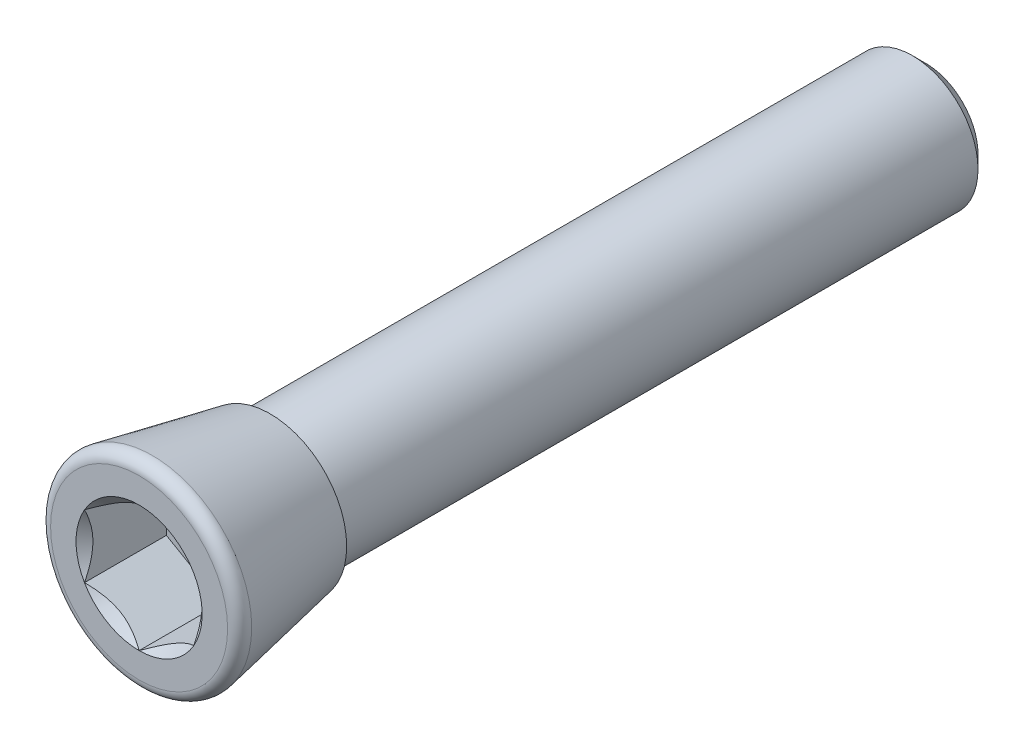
ISO-10303-21;
HEADER;
FILE_DESCRIPTION(('STEP AP214'),'2;1');
FILE_NAME('part.step','',(''),(''),'','','');
FILE_SCHEMA(('AUTOMOTIVE_DESIGN { 1 0 10303 214 1 1 1 1 }'));
ENDSEC;
DATA;
#1=APPLICATION_CONTEXT('core data for automotive mechanical design processes');
#2=APPLICATION_PROTOCOL_DEFINITION('international standard','automotive_design',2000,#1);
#3=PRODUCT_CONTEXT('',#1,'mechanical');
#4=PRODUCT('Part','Part','',(#3));
#5=PRODUCT_RELATED_PRODUCT_CATEGORY('part','',(#4));
#6=PRODUCT_DEFINITION_FORMATION('','',#4);
#7=PRODUCT_DEFINITION_CONTEXT('part definition',#1,'design');
#8=PRODUCT_DEFINITION('design','',#6,#7);
#9=PRODUCT_DEFINITION_SHAPE('','',#8);
#10=(LENGTH_UNIT() NAMED_UNIT(*) SI_UNIT(.MILLI.,.METRE.));
#11=(NAMED_UNIT(*) PLANE_ANGLE_UNIT() SI_UNIT($,.RADIAN.));
#12=(NAMED_UNIT(*) SI_UNIT($,.STERADIAN.) SOLID_ANGLE_UNIT());
#13=UNCERTAINTY_MEASURE_WITH_UNIT(LENGTH_MEASURE(1.E-05),#10,'distance_accuracy_value','');
#14=(GEOMETRIC_REPRESENTATION_CONTEXT(3) GLOBAL_UNCERTAINTY_ASSIGNED_CONTEXT((#13)) GLOBAL_UNIT_ASSIGNED_CONTEXT((#10,
#11,#12)) REPRESENTATION_CONTEXT('',''));
#15=CARTESIAN_POINT('',(0.,0.,0.));
#16=DIRECTION('',(0.,0.,1.));
#17=DIRECTION('',(1.,0.,0.));
#18=AXIS2_PLACEMENT_3D('',#15,#16,#17);
#19=CARTESIAN_POINT('',(0.,0.,0.));
#20=DIRECTION('',(0.,0.,1.));
#21=DIRECTION('',(1.,0.,0.));
#22=AXIS2_PLACEMENT_3D('',#19,#20,#21);
#23=PLANE('',#22);
#24=CARTESIAN_POINT('',(0.,0.,2.9549279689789E-11));
#25=DIRECTION('',(0.,0.,1.));
#26=DIRECTION('',(1.,0.,0.));
#27=AXIS2_PLACEMENT_3D('',#24,#25,#26);
#28=CIRCLE('',#27,3.50127142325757);
#29=CARTESIAN_POINT('',(3.50127142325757,0.,2.9549279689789E-11));
#30=VERTEX_POINT('',#29);
#31=EDGE_CURVE('E233',#30,#30,#28,.T.);
#32=ORIENTED_EDGE('',*,*,#31,.F.);
#33=EDGE_LOOP('',(#32));
#34=FACE_BOUND('',#33,.T.);
#35=CARTESIAN_POINT('',(0.,0.,0.));
#36=DIRECTION('',(0.,0.,1.));
#37=DIRECTION('',(1.,0.,0.));
#38=AXIS2_PLACEMENT_3D('',#35,#36,#37);
#39=CIRCLE('',#38,3.);
#40=CARTESIAN_POINT('',(3.,0.,0.));
#41=VERTEX_POINT('',#40);
#42=EDGE_CURVE('E310',#41,#41,#39,.F.);
#43=ORIENTED_EDGE('',*,*,#42,.F.);
#44=EDGE_LOOP('',(#43));
#45=FACE_BOUND('',#44,.T.);
#46=ADVANCED_FACE('F14',(#34,#45),#23,.F.);
#47=CARTESIAN_POINT('',(2.5,-1.44337567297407,2.25));
#48=DIRECTION('',(1.,0.,0.));
#49=DIRECTION('',(0.,-1.,0.));
#50=AXIS2_PLACEMENT_3D('',#47,#48,#49);
#51=PLANE('',#50);
#52=CARTESIAN_POINT('',(2.49999999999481,1.44337567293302,6.00000000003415));
#53=CARTESIAN_POINT('',(2.49999999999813,1.3448047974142,5.95076054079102));
#54=CARTESIAN_POINT('',(2.4999999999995,1.24459631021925,5.90439618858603));
#55=CARTESIAN_POINT('',(2.5000000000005,1.04022304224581,5.81940939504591));
#56=CARTESIAN_POINT('',(2.50000000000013,0.936037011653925,5.78083850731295));
#57=CARTESIAN_POINT('',(2.49999999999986,0.72465381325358,5.71423485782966));
#58=CARTESIAN_POINT('',(2.49999999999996,0.61746818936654,5.68616643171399));
#59=CARTESIAN_POINT('',(2.50000000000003,0.400747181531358,5.64295393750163));
#60=CARTESIAN_POINT('',(2.50000000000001,0.291220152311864,5.62776990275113));
#61=CARTESIAN_POINT('',(2.5,0.151078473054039,5.6176265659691));
#62=CARTESIAN_POINT('',(2.5,0.120877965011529,5.6159866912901));
#63=CARTESIAN_POINT('',(2.5,0.0604529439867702,5.61379762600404));
#64=CARTESIAN_POINT('',(2.5,0.0302284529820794,5.61324784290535));
#65=CARTESIAN_POINT('',(2.5,-0.0758674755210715,5.61325068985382));
#66=CARTESIAN_POINT('',(2.5,-0.151759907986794,5.61672098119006));
#67=CARTESIAN_POINT('',(2.5,-0.302963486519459,5.63041108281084));
#68=CARTESIAN_POINT('',(2.5,-0.378274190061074,5.6406356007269));
#69=CARTESIAN_POINT('',(2.5,-0.528122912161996,5.66735317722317));
#70=CARTESIAN_POINT('',(2.5,-0.602655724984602,5.6838750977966));
#71=CARTESIAN_POINT('',(2.5,-0.750290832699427,5.72243537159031));
#72=CARTESIAN_POINT('',(2.5,-0.823392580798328,5.74447579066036));
#73=CARTESIAN_POINT('',(2.5,-0.990079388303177,5.80069051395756));
#74=CARTESIAN_POINT('',(2.5,-1.08310139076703,5.83651478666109));
#75=CARTESIAN_POINT('',(2.5,-1.2656234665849,5.9141573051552));
#76=CARTESIAN_POINT('',(2.5,-1.35514797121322,5.95591772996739));
#77=CARTESIAN_POINT('',(2.5,-1.44337567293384,6.0000000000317));
#78=B_SPLINE_CURVE_WITH_KNOTS('',3,(#52,#53,#54,#55,#56,#57,#58,#59,#60,#61,#62,#63,#64,#65,#66,
#67,#68,#69,#70,#71,#72,#73,#74,#75,#76,#77),.UNSPECIFIED.,.F.,.F.,(4,2,2,2,2,2,2,2,2,2,2,2,4),
(0.,0.330782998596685,0.663687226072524,0.995450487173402,1.32618083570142,1.4169022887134,
1.50757441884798,1.73514364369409,1.96287164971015,2.19165616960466,2.42052646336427,
2.71929868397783,3.01533817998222),.UNSPECIFIED.);
#79=CARTESIAN_POINT('',(2.49999999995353,1.44337567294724,5.99999999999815));
#80=VERTEX_POINT('',#79);
#81=CARTESIAN_POINT('',(2.49999999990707,-1.44337567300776,5.9999999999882));
#82=VERTEX_POINT('',#81);
#83=EDGE_CURVE('E69',#80,#82,#78,.T.);
#84=ORIENTED_EDGE('',*,*,#83,.F.);
#85=DIRECTION('',(0.,0.,-1.));
#86=VECTOR('',#85,1.);
#87=CARTESIAN_POINT('',(2.5,1.44337567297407,2.25));
#88=LINE('',#87,#86);
#89=CARTESIAN_POINT('',(2.5,1.44337567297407,2.25));
#90=VERTEX_POINT('',#89);
#91=EDGE_CURVE('E75',#80,#90,#88,.T.);
#92=ORIENTED_EDGE('',*,*,#91,.T.);
#93=DIRECTION('',(0.,1.,0.));
#94=VECTOR('',#93,1.);
#95=CARTESIAN_POINT('',(2.5,0.,2.25));
#96=LINE('',#95,#94);
#97=CARTESIAN_POINT('',(2.5,-1.44337567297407,2.25));
#98=VERTEX_POINT('',#97);
#99=EDGE_CURVE('E79',#90,#98,#96,.F.);
#100=ORIENTED_EDGE('',*,*,#99,.T.);
#101=DIRECTION('',(0.,0.,-1.));
#102=VECTOR('',#101,1.);
#103=CARTESIAN_POINT('',(2.5,-1.44337567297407,2.25));
#104=LINE('',#103,#102);
#105=EDGE_CURVE('E77',#98,#82,#104,.F.);
#106=ORIENTED_EDGE('',*,*,#105,.T.);
#107=EDGE_LOOP('',(#84,#92,#100,#106));
#108=FACE_BOUND('',#107,.T.);
#109=ADVANCED_FACE('F73',(#108),#51,.F.);
#110=CARTESIAN_POINT('',(5.,0.,2.25));
#111=DIRECTION('',(0.,0.,-1.));
#112=DIRECTION('',(-1.,0.,0.));
#113=AXIS2_PLACEMENT_3D('',#110,#111,#112);
#114=PLANE('',#113);
#115=DIRECTION('',(0.866025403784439,0.5,0.));
#116=VECTOR('',#115,1.);
#117=CARTESIAN_POINT('',(0.,2.88675134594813,2.25));
#118=LINE('',#117,#116);
#119=CARTESIAN_POINT('',(0.,2.88675134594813,2.25));
#120=VERTEX_POINT('',#119);
#121=CARTESIAN_POINT('',(-2.5,1.44337567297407,2.25));
#122=VERTEX_POINT('',#121);
#123=EDGE_CURVE('E267',#120,#122,#118,.F.);
#124=ORIENTED_EDGE('',*,*,#123,.T.);
#125=DIRECTION('',(0.,1.,0.));
#126=VECTOR('',#125,1.);
#127=CARTESIAN_POINT('',(-2.5,1.44337567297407,2.25));
#128=LINE('',#127,#126);
#129=CARTESIAN_POINT('',(-2.5,-1.44337567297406,2.25));
#130=VERTEX_POINT('',#129);
#131=EDGE_CURVE('E273',#122,#130,#128,.F.);
#132=ORIENTED_EDGE('',*,*,#131,.T.);
#133=DIRECTION('',(-0.866025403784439,0.5,0.));
#134=VECTOR('',#133,1.);
#135=CARTESIAN_POINT('',(-2.5,-1.44337567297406,2.25));
#136=LINE('',#135,#134);
#137=CARTESIAN_POINT('',(0.,-2.88675134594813,2.25));
#138=VERTEX_POINT('',#137);
#139=EDGE_CURVE('E279',#130,#138,#136,.F.);
#140=ORIENTED_EDGE('',*,*,#139,.T.);
#141=DIRECTION('',(-0.866025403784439,-0.5,0.));
#142=VECTOR('',#141,1.);
#143=CARTESIAN_POINT('',(0.,-2.88675134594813,2.25));
#144=LINE('',#143,#142);
#145=EDGE_CURVE('E100',#138,#98,#144,.F.);
#146=ORIENTED_EDGE('',*,*,#145,.T.);
#147=ORIENTED_EDGE('',*,*,#99,.F.);
#148=DIRECTION('',(0.866025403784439,-0.5,0.));
#149=VECTOR('',#148,1.);
#150=CARTESIAN_POINT('',(2.5,1.44337567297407,2.25));
#151=LINE('',#150,#149);
#152=EDGE_CURVE('E99',#90,#120,#151,.F.);
#153=ORIENTED_EDGE('',*,*,#152,.T.);
#154=EDGE_LOOP('',(#124,#132,#140,#146,#147,#153));
#155=FACE_BOUND('',#154,.T.);
#156=ADVANCED_FACE('F182',(#155),#114,.F.);
#157=CARTESIAN_POINT('',(2.5,1.44337567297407,2.25));
#158=DIRECTION('',(0.5,0.866025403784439,0.));
#159=DIRECTION('',(0.866025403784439,-0.5,0.));
#160=AXIS2_PLACEMENT_3D('',#157,#158,#159);
#161=PLANE('',#160);
#162=CARTESIAN_POINT('',(2.49999999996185,1.4433756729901,6.00000000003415));
#163=CARTESIAN_POINT('',(2.41407377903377,1.49298519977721,5.95043808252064));
#164=CARTESIAN_POINT('',(2.32671086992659,1.54342419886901,5.90378750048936));
#165=CARTESIAN_POINT('',(2.14856893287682,1.64627449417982,5.81837227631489));
#166=CARTESIAN_POINT('',(2.05777297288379,1.69869556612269,5.77965514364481));
#167=CARTESIAN_POINT('',(1.87468737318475,1.80440008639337,5.71333243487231));
#168=CARTESIAN_POINT('',(1.78244433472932,1.85765662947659,5.68556020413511));
#169=CARTESIAN_POINT('',(1.59592809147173,1.96534183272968,5.64277179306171));
#170=CARTESIAN_POINT('',(1.50166058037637,2.01976720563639,5.62772368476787));
#171=CARTESIAN_POINT('',(1.33918618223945,2.11357184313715,5.61414605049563));
#172=CARTESIAN_POINT('',(1.27118905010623,2.15283000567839,5.61213672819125));
#173=CARTESIAN_POINT('',(1.1353060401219,2.23128209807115,5.61552620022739));
#174=CARTESIAN_POINT('',(1.06742020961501,2.27047600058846,5.6209275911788));
#175=CARTESIAN_POINT('',(0.932289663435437,2.34849365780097,5.63883111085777));
#176=CARTESIAN_POINT('',(0.865045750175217,2.38731694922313,5.65134117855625));
#177=CARTESIAN_POINT('',(0.731720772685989,2.46429216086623,5.68277536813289));
#178=CARTESIAN_POINT('',(0.665639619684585,2.50244413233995,5.70169899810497));
#179=CARTESIAN_POINT('',(0.496416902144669,2.60014491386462,5.75786430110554));
#180=CARTESIAN_POINT('',(0.394323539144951,2.65908854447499,5.79933497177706));
#181=CARTESIAN_POINT('',(0.244203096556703,2.74576062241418,5.86934112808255));
#182=CARTESIAN_POINT('',(0.194731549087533,2.77432303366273,5.8939377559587));
#183=CARTESIAN_POINT('',(0.0967044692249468,2.83091899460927,5.9453728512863));
#184=CARTESIAN_POINT('',(0.0481483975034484,2.85895285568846,5.97220994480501));
#185=CARTESIAN_POINT('',(3.91885946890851E-11,2.8867513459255,6.0000000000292));
#186=B_SPLINE_CURVE_WITH_KNOTS('',3,(#162,#163,#164,#165,#166,#167,#168,#169,#170,#171,#172,
#173,#174,#175,#176,#177,#178,#179,#180,#181,#182,#183,#184,#185),.UNSPECIFIED.,.F.,.F.,(4,2,2,
2,2,2,2,2,2,2,2,4),(0.,0.332957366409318,0.66785385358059,0.997433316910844,1.32618330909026,
1.56147590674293,1.79685096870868,2.03248941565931,2.26810979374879,2.6422318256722,
2.82878537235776,3.0152253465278),.UNSPECIFIED.);
#187=CARTESIAN_POINT('',(0.,2.88675134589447,5.99999999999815));
#188=VERTEX_POINT('',#187);
#189=EDGE_CURVE('E96',#80,#188,#186,.T.);
#190=ORIENTED_EDGE('',*,*,#189,.T.);
#191=DIRECTION('',(0.,0.,-1.));
#192=VECTOR('',#191,1.);
#193=CARTESIAN_POINT('',(0.,2.88675134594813,2.25));
#194=LINE('',#193,#192);
#195=EDGE_CURVE('E106',#188,#120,#194,.T.);
#196=ORIENTED_EDGE('',*,*,#195,.T.);
#197=ORIENTED_EDGE('',*,*,#152,.F.);
#198=ORIENTED_EDGE('',*,*,#91,.F.);
#199=EDGE_LOOP('',(#190,#196,#197,#198));
#200=FACE_BOUND('',#199,.T.);
#201=ADVANCED_FACE('F94',(#200),#161,.F.);
#202=CARTESIAN_POINT('',(0.,-2.88675134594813,2.25));
#203=DIRECTION('',(0.5,-0.866025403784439,0.));
#204=DIRECTION('',(-0.866025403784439,-0.5,0.));
#205=AXIS2_PLACEMENT_3D('',#202,#203,#204);
#206=PLANE('',#205);
#207=CARTESIAN_POINT('',(3.62454307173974E-11,-2.88675134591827,6.0000000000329));
#208=CARTESIAN_POINT('',(0.0859262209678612,-2.83714181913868,5.95043808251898));
#209=CARTESIAN_POINT('',(0.173289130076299,-2.78670282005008,5.9037875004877));
#210=CARTESIAN_POINT('',(0.351431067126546,-2.68385252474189,5.81837227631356));
#211=CARTESIAN_POINT('',(0.442227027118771,-2.63143145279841,5.77965514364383));
#212=CARTESIAN_POINT('',(0.625312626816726,-2.52572693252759,5.71333243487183));
#213=CARTESIAN_POINT('',(0.717555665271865,-2.47247038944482,5.68556020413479));
#214=CARTESIAN_POINT('',(0.904071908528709,-2.36478518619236,5.64277179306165));
#215=CARTESIAN_POINT('',(0.998339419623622,-2.31035981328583,5.62772368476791));
#216=CARTESIAN_POINT('',(1.16081381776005,-2.21655517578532,5.61414605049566));
#217=CARTESIAN_POINT('',(1.22881094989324,-2.17729701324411,5.61213672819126));
#218=CARTESIAN_POINT('',(1.36469395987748,-2.09884492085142,5.61552620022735));
#219=CARTESIAN_POINT('',(1.43257979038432,-2.05965101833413,5.62092759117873));
#220=CARTESIAN_POINT('',(1.56771033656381,-1.98163336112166,5.63883111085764));
#221=CARTESIAN_POINT('',(1.63495424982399,-1.94281006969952,5.65134117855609));
#222=CARTESIAN_POINT('',(1.76827922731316,-1.86583485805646,5.68277536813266));
#223=CARTESIAN_POINT('',(1.83436038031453,-1.82768288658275,5.70169899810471));
#224=CARTESIAN_POINT('',(2.00358309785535,-1.72998210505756,5.7578643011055));
#225=CARTESIAN_POINT('',(2.10567646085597,-1.67103847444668,5.79933497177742));
#226=CARTESIAN_POINT('',(2.25579690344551,-1.58436639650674,5.86934112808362));
#227=CARTESIAN_POINT('',(2.3052684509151,-1.55580398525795,5.89393775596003));
#228=CARTESIAN_POINT('',(2.40329553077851,-1.49920802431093,5.94537285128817));
#229=CARTESIAN_POINT('',(2.45185160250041,-1.4711741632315,5.97220994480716));
#230=CARTESIAN_POINT('',(2.49999999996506,-1.44337567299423,6.00000000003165));
#231=B_SPLINE_CURVE_WITH_KNOTS('',3,(#207,#208,#209,#210,#211,#212,#213,#214,#215,#216,#217,
#218,#219,#220,#221,#222,#223,#224,#225,#226,#227,#228,#229,#230),.UNSPECIFIED.,.F.,.F.,(4,2,2,
2,2,2,2,2,2,2,2,4),(0.,0.332957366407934,0.667853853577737,0.997433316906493,1.32618330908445,
1.56147590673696,1.79685096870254,2.03248941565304,2.26810979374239,2.64223182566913,
2.82878537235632,3.01522534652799),.UNSPECIFIED.);
#232=CARTESIAN_POINT('',(-7.36095430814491E-11,-2.88675134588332,5.999999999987));
#233=VERTEX_POINT('',#232);
#234=EDGE_CURVE('E105',#233,#82,#231,.T.);
#235=ORIENTED_EDGE('',*,*,#234,.T.);
#236=ORIENTED_EDGE('',*,*,#105,.F.);
#237=ORIENTED_EDGE('',*,*,#145,.F.);
#238=DIRECTION('',(0.,0.,-1.));
#239=VECTOR('',#238,1.);
#240=CARTESIAN_POINT('',(0.,-2.88675134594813,2.25));
#241=LINE('',#240,#239);
#242=EDGE_CURVE('E276',#138,#233,#241,.F.);
#243=ORIENTED_EDGE('',*,*,#242,.T.);
#244=EDGE_LOOP('',(#235,#236,#237,#243));
#245=FACE_BOUND('',#244,.T.);
#246=ADVANCED_FACE('F172',(#245),#206,.F.);
#247=CARTESIAN_POINT('',(-2.5,-1.44337567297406,2.25));
#248=DIRECTION('',(-0.5,-0.866025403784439,0.));
#249=DIRECTION('',(-0.866025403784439,0.5,0.));
#250=AXIS2_PLACEMENT_3D('',#247,#248,#249);
#251=PLANE('',#250);
#252=CARTESIAN_POINT('',(-2.49999999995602,-1.44337567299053,6.0000000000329));
#253=CARTESIAN_POINT('',(-2.41407377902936,-1.4929851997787,5.95043808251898));
#254=CARTESIAN_POINT('',(-2.32671086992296,-1.54342419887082,5.9037875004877));
#255=CARTESIAN_POINT('',(-2.14856893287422,-1.6462744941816,5.81837227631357));
#256=CARTESIAN_POINT('',(-2.05777297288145,-1.69869556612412,5.77965514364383));
#257=CARTESIAN_POINT('',(-1.8746873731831,-1.80440008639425,5.71333243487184));
#258=CARTESIAN_POINT('',(-1.7824443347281,-1.85765662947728,5.68556020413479));
#259=CARTESIAN_POINT('',(-1.59592809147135,-1.96534183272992,5.64277179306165));
#260=CARTESIAN_POINT('',(-1.5016605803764,-2.01976720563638,5.62772368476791));
#261=CARTESIAN_POINT('',(-1.33918618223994,-2.11357184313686,5.61414605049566));
#262=CARTESIAN_POINT('',(-1.27118905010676,-2.15283000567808,5.61213672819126));
#263=CARTESIAN_POINT('',(-1.13530604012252,-2.23128209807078,5.61552620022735));
#264=CARTESIAN_POINT('',(-1.06742020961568,-2.27047600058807,5.62092759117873));
#265=CARTESIAN_POINT('',(-0.932289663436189,-2.34849365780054,5.63883111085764));
#266=CARTESIAN_POINT('',(-0.865045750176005,-2.38731694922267,5.65134117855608));
#267=CARTESIAN_POINT('',(-0.731720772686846,-2.46429216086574,5.68277536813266));
#268=CARTESIAN_POINT('',(-0.665639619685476,-2.50244413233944,5.70169899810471));
#269=CARTESIAN_POINT('',(-0.496416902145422,-2.60014491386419,5.75786430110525));
#270=CARTESIAN_POINT('',(-0.394323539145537,-2.65908854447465,5.79933497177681));
#271=CARTESIAN_POINT('',(-0.244203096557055,-2.74576062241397,5.86934112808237));
#272=CARTESIAN_POINT('',(-0.194731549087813,-2.77432303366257,5.89393775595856));
#273=CARTESIAN_POINT('',(-0.0967044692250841,-2.83091899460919,5.94537285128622));
#274=CARTESIAN_POINT('',(-0.0481483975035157,-2.85895285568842,5.97220994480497));
#275=CARTESIAN_POINT('',(-3.91871245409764E-11,-2.8867513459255,6.0000000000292));
#276=B_SPLINE_CURVE_WITH_KNOTS('',3,(#252,#253,#254,#255,#256,#257,#258,#259,#260,#261,#262,
#263,#264,#265,#266,#267,#268,#269,#270,#271,#272,#273,#274,#275),.UNSPECIFIED.,.F.,.F.,(4,2,2,
2,2,2,2,2,2,2,2,4),(0.,0.332957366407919,0.667853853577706,0.997433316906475,1.32618330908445,
1.56147590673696,1.79685096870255,2.03248941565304,2.26810979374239,2.64223182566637,
2.8287853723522,3.0152253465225),.UNSPECIFIED.);
#277=CARTESIAN_POINT('',(-2.49999999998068,-1.44337567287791,5.999999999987));
#278=VERTEX_POINT('',#277);
#279=EDGE_CURVE('E155',#278,#233,#276,.T.);
#280=ORIENTED_EDGE('',*,*,#279,.T.);
#281=ORIENTED_EDGE('',*,*,#242,.F.);
#282=ORIENTED_EDGE('',*,*,#139,.F.);
#283=DIRECTION('',(0.,0.,1.));
#284=VECTOR('',#283,1.);
#285=CARTESIAN_POINT('',(-2.5,-1.44337567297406,2.25));
#286=LINE('',#285,#284);
#287=EDGE_CURVE('E270',#130,#278,#286,.T.);
#288=ORIENTED_EDGE('',*,*,#287,.T.);
#289=EDGE_LOOP('',(#280,#281,#282,#288));
#290=FACE_BOUND('',#289,.T.);
#291=ADVANCED_FACE('F168',(#290),#251,.F.);
#292=CARTESIAN_POINT('',(-2.5,1.44337567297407,2.25));
#293=DIRECTION('',(-1.,0.,0.));
#294=DIRECTION('',(0.,0.,1.));
#295=AXIS2_PLACEMENT_3D('',#292,#293,#294);
#296=PLANE('',#295);
#297=CARTESIAN_POINT('',(-2.49999999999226,1.44337567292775,6.0000000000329));
#298=CARTESIAN_POINT('',(-2.49999999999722,1.34415661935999,5.95043808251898));
#299=CARTESIAN_POINT('',(-2.49999999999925,1.2432786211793,5.9037875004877));
#300=CARTESIAN_POINT('',(-2.50000000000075,1.03757803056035,5.81837227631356));
#301=CARTESIAN_POINT('',(-2.5000000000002,0.932735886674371,5.77965514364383));
#302=CARTESIAN_POINT('',(-2.4999999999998,0.72132684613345,5.71333243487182));
#303=CARTESIAN_POINT('',(-2.49999999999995,0.614813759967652,5.68556020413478));
#304=CARTESIAN_POINT('',(-2.50000000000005,0.399443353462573,5.64277179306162));
#305=CARTESIAN_POINT('',(-2.50000000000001,0.290592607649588,5.62772368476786));
#306=CARTESIAN_POINT('',(-2.49999999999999,0.102983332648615,5.61414605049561));
#307=CARTESIAN_POINT('',(-2.5,0.0244670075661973,5.61213672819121));
#308=CARTESIAN_POINT('',(-2.5,-0.132437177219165,5.61552620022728));
#309=CARTESIAN_POINT('',(-2.5,-0.210824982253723,5.62092759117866));
#310=CARTESIAN_POINT('',(-2.5,-0.366860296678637,5.63883111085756));
#311=CARTESIAN_POINT('',(-2.5,-0.444506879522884,5.65134117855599));
#312=CARTESIAN_POINT('',(-2.5,-0.598457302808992,5.68277536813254));
#313=CARTESIAN_POINT('',(-2.5,-0.674761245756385,5.70169899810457));
#314=CARTESIAN_POINT('',(-2.5,-0.87016280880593,5.7578643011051));
#315=CARTESIAN_POINT('',(-2.5,-0.988050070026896,5.7993349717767));
#316=CARTESIAN_POINT('',(-2.5,-1.16139422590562,5.8693411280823));
#317=CARTESIAN_POINT('',(-2.5,-1.21851904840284,5.8939377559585));
#318=CARTESIAN_POINT('',(-2.5,-1.33171097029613,5.94537285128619));
#319=CARTESIAN_POINT('',(-2.5,-1.38777869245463,5.97220994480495));
#320=CARTESIAN_POINT('',(-2.5,-1.44337567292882,6.0000000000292));
#321=B_SPLINE_CURVE_WITH_KNOTS('',3,(#297,#298,#299,#300,#301,#302,#303,#304,#305,#306,#307,
#308,#309,#310,#311,#312,#313,#314,#315,#316,#317,#318,#319,#320),.UNSPECIFIED.,.F.,.F.,(4,2,2,
2,2,2,2,2,2,2,2,4),(0.,0.332957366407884,0.66785385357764,0.997433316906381,1.32618330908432,
1.56147590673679,1.79685096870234,2.03248941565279,2.26810979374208,2.64223182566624,
2.82878537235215,3.01522534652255),.UNSPECIFIED.);
#322=CARTESIAN_POINT('',(-2.49999999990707,1.44337567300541,5.999999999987));
#323=VERTEX_POINT('',#322);
#324=EDGE_CURVE('E115',#323,#278,#321,.T.);
#325=ORIENTED_EDGE('',*,*,#324,.T.);
#326=ORIENTED_EDGE('',*,*,#287,.F.);
#327=ORIENTED_EDGE('',*,*,#131,.F.);
#328=DIRECTION('',(0.,0.,-1.));
#329=VECTOR('',#328,1.);
#330=CARTESIAN_POINT('',(-2.5,1.44337567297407,2.25));
#331=LINE('',#330,#329);
#332=EDGE_CURVE('E262',#122,#323,#331,.F.);
#333=ORIENTED_EDGE('',*,*,#332,.T.);
#334=EDGE_LOOP('',(#325,#326,#327,#333));
#335=FACE_BOUND('',#334,.T.);
#336=ADVANCED_FACE('F171',(#335),#296,.F.);
#337=CARTESIAN_POINT('',(0.,2.88675134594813,2.25));
#338=DIRECTION('',(-0.5,0.866025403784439,0.));
#339=DIRECTION('',(0.866025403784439,0.5,0.));
#340=AXIS2_PLACEMENT_3D('',#337,#338,#339);
#341=PLANE('',#340);
#342=CARTESIAN_POINT('',(-3.62457943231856E-11,2.88675134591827,6.0000000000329));
#343=CARTESIAN_POINT('',(-0.0859262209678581,2.83714181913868,5.95043808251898));
#344=CARTESIAN_POINT('',(-0.173289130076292,2.78670282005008,5.9037875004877));
#345=CARTESIAN_POINT('',(-0.351431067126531,2.6838525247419,5.81837227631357));
#346=CARTESIAN_POINT('',(-0.442227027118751,2.63143145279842,5.77965514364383));
#347=CARTESIAN_POINT('',(-0.625312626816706,2.52572693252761,5.71333243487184));
#348=CARTESIAN_POINT('',(-0.717555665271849,2.47247038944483,5.6855602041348));
#349=CARTESIAN_POINT('',(-0.904071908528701,2.36478518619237,5.64277179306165));
#350=CARTESIAN_POINT('',(-0.998339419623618,2.31035981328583,5.62772368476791));
#351=CARTESIAN_POINT('',(-1.16081381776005,2.21655517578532,5.61414605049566));
#352=CARTESIAN_POINT('',(-1.22881094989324,2.1772970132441,5.61213672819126));
#353=CARTESIAN_POINT('',(-1.36469395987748,2.09884492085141,5.61552620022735));
#354=CARTESIAN_POINT('',(-1.43257979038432,2.05965101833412,5.62092759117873));
#355=CARTESIAN_POINT('',(-1.56771033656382,1.98163336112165,5.63883111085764));
#356=CARTESIAN_POINT('',(-1.634954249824,1.94281006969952,5.65134117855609));
#357=CARTESIAN_POINT('',(-1.76827922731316,1.86583485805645,5.68277536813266));
#358=CARTESIAN_POINT('',(-1.83436038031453,1.82768288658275,5.70169899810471));
#359=CARTESIAN_POINT('',(-2.00358309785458,1.729982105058,5.75786430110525));
#360=CARTESIAN_POINT('',(-2.10567646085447,1.67103847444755,5.79933497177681));
#361=CARTESIAN_POINT('',(-2.25579690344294,1.58436639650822,5.86934112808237));
#362=CARTESIAN_POINT('',(-2.30526845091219,1.55580398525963,5.89393775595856));
#363=CARTESIAN_POINT('',(-2.40329553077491,1.49920802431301,5.94537285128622));
#364=CARTESIAN_POINT('',(-2.45185160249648,1.47117416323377,5.97220994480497));
#365=CARTESIAN_POINT('',(-2.49999999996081,1.44337567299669,6.0000000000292));
#366=B_SPLINE_CURVE_WITH_KNOTS('',3,(#342,#343,#344,#345,#346,#347,#348,#349,#350,#351,#352,
#353,#354,#355,#356,#357,#358,#359,#360,#361,#362,#363,#364,#365),.UNSPECIFIED.,.F.,.F.,(4,2,2,
2,2,2,2,2,2,2,2,4),(0.,0.33295736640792,0.667853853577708,0.997433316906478,1.32618330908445,
1.56147590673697,1.79685096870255,2.03248941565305,2.26810979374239,2.64223182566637,
2.8287853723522,3.0152253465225),.UNSPECIFIED.);
#367=EDGE_CURVE('E112',#188,#323,#366,.T.);
#368=ORIENTED_EDGE('',*,*,#367,.T.);
#369=ORIENTED_EDGE('',*,*,#332,.F.);
#370=ORIENTED_EDGE('',*,*,#123,.F.);
#371=ORIENTED_EDGE('',*,*,#195,.F.);
#372=EDGE_LOOP('',(#368,#369,#370,#371));
#373=FACE_BOUND('',#372,.T.);
#374=ADVANCED_FACE('F132',(#373),#341,.F.);
#375=CARTESIAN_POINT('',(0.,0.,5.99999999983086));
#376=DIRECTION('',(0.,0.,1.));
#377=DIRECTION('',(1.,0.,0.));
#378=AXIS2_PLACEMENT_3D('',#375,#376,#377);
#379=CONICAL_SURFACE('',#378,2.88675134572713,0.785398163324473);
#380=ORIENTED_EDGE('',*,*,#189,.F.);
#381=CARTESIAN_POINT('',(0.,0.,5.9999999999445));
#382=DIRECTION('',(0.,0.,1.));
#383=DIRECTION('',(1.,0.,0.));
#384=AXIS2_PLACEMENT_3D('',#381,#382,#383);
#385=CIRCLE('',#384,2.88675134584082);
#386=EDGE_CURVE('E88',#188,#80,#385,.F.);
#387=ORIENTED_EDGE('',*,*,#386,.F.);
#388=EDGE_LOOP('',(#380,#387));
#389=FACE_BOUND('',#388,.T.);
#390=ADVANCED_FACE('F104',(#389),#379,.F.);
#391=CARTESIAN_POINT('',(0.,0.,5.99999999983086));
#392=DIRECTION('',(0.,0.,1.));
#393=DIRECTION('',(1.,0.,0.));
#394=AXIS2_PLACEMENT_3D('',#391,#392,#393);
#395=CONICAL_SURFACE('',#394,2.88675134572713,0.785398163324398);
#396=ORIENTED_EDGE('',*,*,#83,.T.);
#397=CARTESIAN_POINT('',(0.,0.,5.9999999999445));
#398=DIRECTION('',(0.,0.,1.));
#399=DIRECTION('',(1.,0.,0.));
#400=AXIS2_PLACEMENT_3D('',#397,#398,#399);
#401=CIRCLE('',#400,2.88675134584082);
#402=EDGE_CURVE('E81',#80,#82,#401,.F.);
#403=ORIENTED_EDGE('',*,*,#402,.F.);
#404=EDGE_LOOP('',(#396,#403));
#405=FACE_BOUND('',#404,.T.);
#406=ADVANCED_FACE('F82',(#405),#395,.F.);
#407=CARTESIAN_POINT('',(0.,0.,5.99999999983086));
#408=DIRECTION('',(0.,0.,1.));
#409=DIRECTION('',(1.,0.,0.));
#410=AXIS2_PLACEMENT_3D('',#407,#408,#409);
#411=CONICAL_SURFACE('',#410,2.88675134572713,0.785398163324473);
#412=ORIENTED_EDGE('',*,*,#234,.F.);
#413=CARTESIAN_POINT('',(0.,0.,5.9999999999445));
#414=DIRECTION('',(0.,0.,1.));
#415=DIRECTION('',(1.,0.,0.));
#416=AXIS2_PLACEMENT_3D('',#413,#414,#415);
#417=CIRCLE('',#416,2.88675134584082);
#418=EDGE_CURVE('E87',#82,#233,#417,.F.);
#419=ORIENTED_EDGE('',*,*,#418,.F.);
#420=EDGE_LOOP('',(#412,#419));
#421=FACE_BOUND('',#420,.T.);
#422=ADVANCED_FACE('F151',(#421),#411,.F.);
#423=CARTESIAN_POINT('',(0.,0.,5.99999999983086));
#424=DIRECTION('',(0.,0.,1.));
#425=DIRECTION('',(1.,0.,0.));
#426=AXIS2_PLACEMENT_3D('',#423,#424,#425);
#427=CONICAL_SURFACE('',#426,2.88675134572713,0.785398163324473);
#428=ORIENTED_EDGE('',*,*,#279,.F.);
#429=CARTESIAN_POINT('',(0.,0.,5.9999999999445));
#430=DIRECTION('',(0.,0.,1.));
#431=DIRECTION('',(1.,0.,0.));
#432=AXIS2_PLACEMENT_3D('',#429,#430,#431);
#433=CIRCLE('',#432,2.88675134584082);
#434=EDGE_CURVE('E314',#233,#278,#433,.F.);
#435=ORIENTED_EDGE('',*,*,#434,.F.);
#436=EDGE_LOOP('',(#428,#435));
#437=FACE_BOUND('',#436,.T.);
#438=ADVANCED_FACE('F146',(#437),#427,.F.);
#439=CARTESIAN_POINT('',(0.,0.,5.99999999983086));
#440=DIRECTION('',(0.,0.,1.));
#441=DIRECTION('',(1.,0.,0.));
#442=AXIS2_PLACEMENT_3D('',#439,#440,#441);
#443=CONICAL_SURFACE('',#442,2.88675134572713,0.785398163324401);
#444=ORIENTED_EDGE('',*,*,#324,.F.);
#445=CARTESIAN_POINT('',(0.,0.,5.9999999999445));
#446=DIRECTION('',(0.,0.,1.));
#447=DIRECTION('',(1.,0.,0.));
#448=AXIS2_PLACEMENT_3D('',#445,#446,#447);
#449=CIRCLE('',#448,2.88675134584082);
#450=EDGE_CURVE('E312',#278,#323,#449,.F.);
#451=ORIENTED_EDGE('',*,*,#450,.F.);
#452=EDGE_LOOP('',(#444,#451));
#453=FACE_BOUND('',#452,.T.);
#454=ADVANCED_FACE('F139',(#453),#443,.F.);
#455=CARTESIAN_POINT('',(0.,0.,5.99999999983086));
#456=DIRECTION('',(0.,0.,1.));
#457=DIRECTION('',(1.,0.,0.));
#458=AXIS2_PLACEMENT_3D('',#455,#456,#457);
#459=CONICAL_SURFACE('',#458,2.88675134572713,0.785398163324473);
#460=ORIENTED_EDGE('',*,*,#367,.F.);
#461=CARTESIAN_POINT('',(0.,0.,5.9999999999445));
#462=DIRECTION('',(0.,0.,1.));
#463=DIRECTION('',(1.,0.,0.));
#464=AXIS2_PLACEMENT_3D('',#461,#462,#463);
#465=CIRCLE('',#464,2.88675134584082);
#466=EDGE_CURVE('E111',#323,#188,#465,.F.);
#467=ORIENTED_EDGE('',*,*,#466,.F.);
#468=EDGE_LOOP('',(#460,#467));
#469=FACE_BOUND('',#468,.T.);
#470=ADVANCED_FACE('F135',(#469),#459,.F.);
#471=CARTESIAN_POINT('',(0.,0.,6.));
#472=DIRECTION('',(0.,0.,1.));
#473=DIRECTION('',(1.,0.,0.));
#474=AXIS2_PLACEMENT_3D('',#471,#472,#473);
#475=PLANE('',#474);
#476=CARTESIAN_POINT('',(0.,0.,6.));
#477=DIRECTION('',(0.,0.,-1.));
#478=DIRECTION('',(-1.,0.,0.));
#479=AXIS2_PLACEMENT_3D('',#476,#477,#478);
#480=CIRCLE('',#479,4.0513);
#481=CARTESIAN_POINT('',(-4.0513,0.,6.));
#482=VERTEX_POINT('',#481);
#483=CARTESIAN_POINT('',(4.0513,0.,6.));
#484=VERTEX_POINT('',#483);
#485=EDGE_CURVE('E236',#482,#484,#480,.T.);
#486=ORIENTED_EDGE('',*,*,#485,.F.);
#487=CARTESIAN_POINT('',(0.,0.,6.));
#488=DIRECTION('',(0.,0.,-1.));
#489=DIRECTION('',(1.,0.,0.));
#490=AXIS2_PLACEMENT_3D('',#487,#488,#489);
#491=CIRCLE('',#490,4.0513);
#492=EDGE_CURVE('E30',#484,#482,#491,.T.);
#493=ORIENTED_EDGE('',*,*,#492,.F.);
#494=EDGE_LOOP('',(#486,#493));
#495=FACE_BOUND('',#494,.T.);
#496=ORIENTED_EDGE('',*,*,#450,.T.);
#497=ORIENTED_EDGE('',*,*,#466,.T.);
#498=ORIENTED_EDGE('',*,*,#386,.T.);
#499=ORIENTED_EDGE('',*,*,#402,.T.);
#500=ORIENTED_EDGE('',*,*,#418,.T.);
#501=ORIENTED_EDGE('',*,*,#434,.T.);
#502=EDGE_LOOP('',(#496,#497,#498,#499,#500,#501));
#503=FACE_BOUND('',#502,.T.);
#504=ADVANCED_FACE('F109',(#495,#503),#475,.T.);
#505=CARTESIAN_POINT('',(0.,0.,5.492));
#506=DIRECTION('',(0.,0.,-1.));
#507=DIRECTION('',(-1.,0.,0.));
#508=AXIS2_PLACEMENT_3D('',#505,#506,#507);
#509=TOROIDAL_SURFACE('',#508,4.0513,0.508);
#510=ORIENTED_EDGE('',*,*,#485,.T.);
#511=ORIENTED_EDGE('',*,*,#492,.T.);
#512=EDGE_LOOP('',(#510,#511));
#513=FACE_BOUND('',#512,.T.);
#514=CARTESIAN_POINT('',(0.,0.,5.3950690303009));
#515=DIRECTION('',(0.,0.,1.));
#516=DIRECTION('',(1.,0.,0.));
#517=AXIS2_PLACEMENT_3D('',#514,#515,#516);
#518=CIRCLE('',#517,4.54996660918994);
#519=CARTESIAN_POINT('',(4.54996660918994,0.,5.3950690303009));
#520=VERTEX_POINT('',#519);
#521=EDGE_CURVE('E230',#520,#520,#518,.F.);
#522=ORIENTED_EDGE('',*,*,#521,.F.);
#523=EDGE_LOOP('',(#522));
#524=FACE_BOUND('',#523,.T.);
#525=ADVANCED_FACE('F214',(#513,#524),#509,.T.);
#526=CARTESIAN_POINT('',(0.,0.,5.3950690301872));
#527=DIRECTION('',(0.,0.,1.));
#528=DIRECTION('',(1.,0.,0.));
#529=AXIS2_PLACEMENT_3D('',#526,#527,#528);
#530=CONICAL_SURFACE('',#529,4.54996660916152,0.191986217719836);
#531=ORIENTED_EDGE('',*,*,#31,.T.);
#532=EDGE_LOOP('',(#531));
#533=FACE_BOUND('',#532,.T.);
#534=ORIENTED_EDGE('',*,*,#521,.T.);
#535=EDGE_LOOP('',(#534));
#536=FACE_BOUND('',#535,.T.);
#537=ADVANCED_FACE('F204',(#533,#536),#530,.T.);
#538=CARTESIAN_POINT('',(0.,0.,-30.));
#539=DIRECTION('',(0.,0.,1.));
#540=DIRECTION('',(1.,0.,0.));
#541=AXIS2_PLACEMENT_3D('',#538,#539,#540);
#542=CYLINDRICAL_SURFACE('',#541,3.);
#543=CARTESIAN_POINT('',(0.,0.,-29.4));
#544=DIRECTION('',(0.,0.,-1.));
#545=DIRECTION('',(-1.,0.,0.));
#546=AXIS2_PLACEMENT_3D('',#543,#544,#545);
#547=CIRCLE('',#546,3.);
#548=CARTESIAN_POINT('',(-3.,0.,-29.4));
#549=VERTEX_POINT('',#548);
#550=EDGE_CURVE('E9',#549,#549,#547,.F.);
#551=ORIENTED_EDGE('',*,*,#550,.T.);
#552=EDGE_LOOP('',(#551));
#553=FACE_BOUND('',#552,.T.);
#554=ORIENTED_EDGE('',*,*,#42,.T.);
#555=EDGE_LOOP('',(#554));
#556=FACE_BOUND('',#555,.T.);
#557=ADVANCED_FACE('F208',(#553,#556),#542,.T.);
#558=CARTESIAN_POINT('',(0.,0.,-30.));
#559=DIRECTION('',(0.,0.,-1.));
#560=DIRECTION('',(-1.,0.,0.));
#561=AXIS2_PLACEMENT_3D('',#558,#559,#560);
#562=PLANE('',#561);
#563=CARTESIAN_POINT('',(0.,0.,-30.));
#564=DIRECTION('',(0.,0.,-1.));
#565=DIRECTION('',(-1.,0.,0.));
#566=AXIS2_PLACEMENT_3D('',#563,#564,#565);
#567=CIRCLE('',#566,2.4);
#568=CARTESIAN_POINT('',(-2.4,0.,-30.));
#569=VERTEX_POINT('',#568);
#570=EDGE_CURVE('E23',#569,#569,#567,.T.);
#571=ORIENTED_EDGE('',*,*,#570,.T.);
#572=EDGE_LOOP('',(#571));
#573=FACE_BOUND('',#572,.T.);
#574=ADVANCED_FACE('F220',(#573),#562,.T.);
#575=CARTESIAN_POINT('',(0.,0.,-30.));
#576=DIRECTION('',(0.,0.,1.));
#577=DIRECTION('',(1.,0.,0.));
#578=AXIS2_PLACEMENT_3D('',#575,#576,#577);
#579=CONICAL_SURFACE('',#578,2.4,0.78539816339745);
#580=ORIENTED_EDGE('',*,*,#550,.F.);
#581=EDGE_LOOP('',(#580));
#582=FACE_BOUND('',#581,.T.);
#583=ORIENTED_EDGE('',*,*,#570,.F.);
#584=EDGE_LOOP('',(#583));
#585=FACE_BOUND('',#584,.T.);
#586=ADVANCED_FACE('F16',(#582,#585),#579,.T.);
#587=CLOSED_SHELL('',(#46,#109,#156,#201,#246,#291,#336,#374,#390,#406,#422,#438,#454,#470,#504,
#525,#537,#557,#574,#586));
#588=MANIFOLD_SOLID_BREP('B1',#587);
#589=ADVANCED_BREP_SHAPE_REPRESENTATION('',(#18,#588),#14);
#590=SHAPE_DEFINITION_REPRESENTATION(#9,#589);
ENDSEC;
END-ISO-10303-21;
